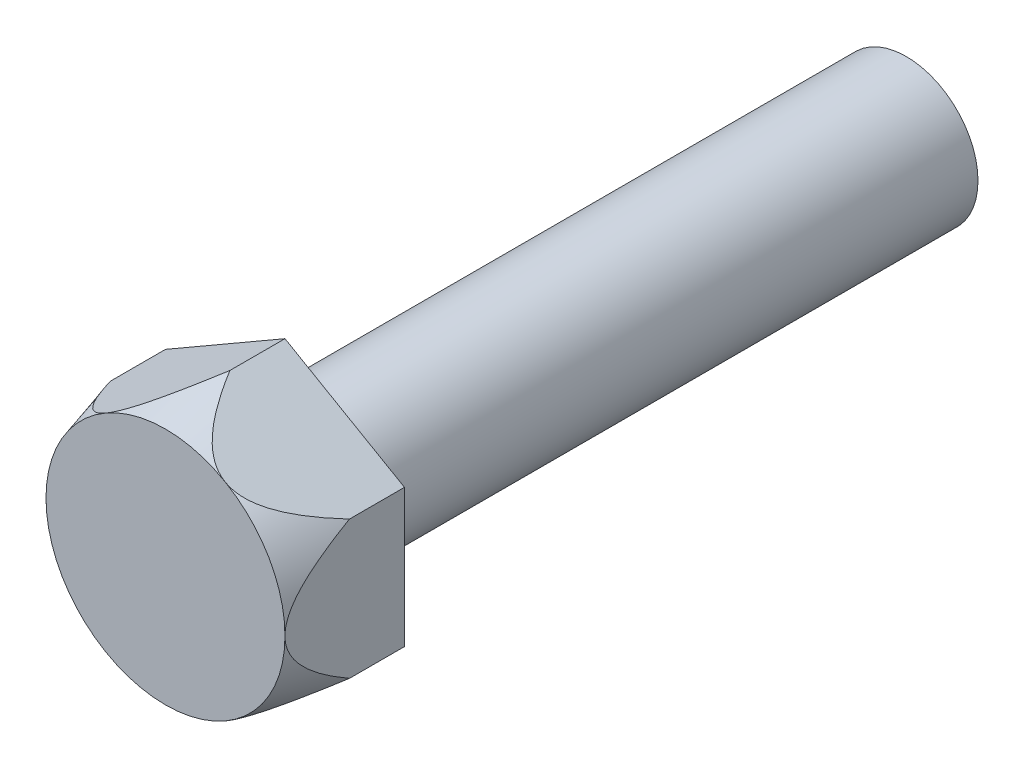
ISO-10303-21;
HEADER;
FILE_DESCRIPTION(('STEP AP214'),'2;1');
FILE_NAME('part.step','',(''),(''),'','','');
FILE_SCHEMA(('AUTOMOTIVE_DESIGN { 1 0 10303 214 1 1 1 1 }'));
ENDSEC;
DATA;
#1=APPLICATION_CONTEXT('core data for automotive mechanical design processes');
#2=APPLICATION_PROTOCOL_DEFINITION('international standard','automotive_design',2000,#1);
#3=PRODUCT_CONTEXT('',#1,'mechanical');
#4=PRODUCT('Part','Part','',(#3));
#5=PRODUCT_RELATED_PRODUCT_CATEGORY('part','',(#4));
#6=PRODUCT_DEFINITION_FORMATION('','',#4);
#7=PRODUCT_DEFINITION_CONTEXT('part definition',#1,'design');
#8=PRODUCT_DEFINITION('design','',#6,#7);
#9=PRODUCT_DEFINITION_SHAPE('','',#8);
#10=(LENGTH_UNIT() NAMED_UNIT(*) SI_UNIT(.MILLI.,.METRE.));
#11=(NAMED_UNIT(*) PLANE_ANGLE_UNIT() SI_UNIT($,.RADIAN.));
#12=(NAMED_UNIT(*) SI_UNIT($,.STERADIAN.) SOLID_ANGLE_UNIT());
#13=UNCERTAINTY_MEASURE_WITH_UNIT(LENGTH_MEASURE(1.E-05),#10,'distance_accuracy_value','');
#14=(GEOMETRIC_REPRESENTATION_CONTEXT(3) GLOBAL_UNCERTAINTY_ASSIGNED_CONTEXT((#13)) GLOBAL_UNIT_ASSIGNED_CONTEXT((#10,
#11,#12)) REPRESENTATION_CONTEXT('',''));
#15=CARTESIAN_POINT('',(0.,0.,0.));
#16=DIRECTION('',(0.,0.,1.));
#17=DIRECTION('',(1.,0.,0.));
#18=AXIS2_PLACEMENT_3D('',#15,#16,#17);
#19=CARTESIAN_POINT('',(0.,2.88675134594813,0.));
#20=DIRECTION('',(0.,0.,1.));
#21=DIRECTION('',(1.,0.,0.));
#22=AXIS2_PLACEMENT_3D('',#19,#20,#21);
#23=PLANE('',#22);
#24=DIRECTION('',(-0.866025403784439,0.5,0.));
#25=VECTOR('',#24,1.);
#26=CARTESIAN_POINT('',(2.5,1.44337567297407,0.));
#27=LINE('',#26,#25);
#28=CARTESIAN_POINT('',(2.5,1.44337567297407,0.));
#29=VERTEX_POINT('',#28);
#30=CARTESIAN_POINT('',(0.,2.88675134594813,0.));
#31=VERTEX_POINT('',#30);
#32=EDGE_CURVE('E113',#29,#31,#27,.T.);
#33=ORIENTED_EDGE('',*,*,#32,.F.);
#34=DIRECTION('',(0.,1.,0.));
#35=VECTOR('',#34,1.);
#36=CARTESIAN_POINT('',(2.5,-1.44337567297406,0.));
#37=LINE('',#36,#35);
#38=CARTESIAN_POINT('',(2.5,-1.44337567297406,0.));
#39=VERTEX_POINT('',#38);
#40=EDGE_CURVE('E260',#39,#29,#37,.T.);
#41=ORIENTED_EDGE('',*,*,#40,.F.);
#42=DIRECTION('',(0.866025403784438,0.5,0.));
#43=VECTOR('',#42,1.);
#44=CARTESIAN_POINT('',(0.,-2.88675134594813,0.));
#45=LINE('',#44,#43);
#46=CARTESIAN_POINT('',(0.,-2.88675134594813,0.));
#47=VERTEX_POINT('',#46);
#48=EDGE_CURVE('E258',#47,#39,#45,.T.);
#49=ORIENTED_EDGE('',*,*,#48,.F.);
#50=DIRECTION('',(0.866025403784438,-0.500000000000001,0.));
#51=VECTOR('',#50,1.);
#52=CARTESIAN_POINT('',(-2.5,-1.44337567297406,0.));
#53=LINE('',#52,#51);
#54=CARTESIAN_POINT('',(-2.5,-1.44337567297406,0.));
#55=VERTEX_POINT('',#54);
#56=EDGE_CURVE('E223',#55,#47,#53,.T.);
#57=ORIENTED_EDGE('',*,*,#56,.F.);
#58=DIRECTION('',(0.,-1.,0.));
#59=VECTOR('',#58,1.);
#60=CARTESIAN_POINT('',(-2.5,1.44337567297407,0.));
#61=LINE('',#60,#59);
#62=CARTESIAN_POINT('',(-2.5,1.44337567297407,0.));
#63=VERTEX_POINT('',#62);
#64=EDGE_CURVE('E266',#63,#55,#61,.T.);
#65=ORIENTED_EDGE('',*,*,#64,.F.);
#66=DIRECTION('',(-0.866025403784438,-0.5,0.));
#67=VECTOR('',#66,1.);
#68=CARTESIAN_POINT('',(0.,2.88675134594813,0.));
#69=LINE('',#68,#67);
#70=EDGE_CURVE('E267',#31,#63,#69,.T.);
#71=ORIENTED_EDGE('',*,*,#70,.F.);
#72=EDGE_LOOP('',(#33,#41,#49,#57,#65,#71));
#73=FACE_BOUND('',#72,.T.);
#74=CARTESIAN_POINT('',(0.,0.,0.));
#75=DIRECTION('',(0.,0.,1.));
#76=DIRECTION('',(1.,0.,0.));
#77=AXIS2_PLACEMENT_3D('',#74,#75,#76);
#78=CIRCLE('',#77,1.5);
#79=CARTESIAN_POINT('',(1.5,0.,0.));
#80=VERTEX_POINT('',#79);
#81=EDGE_CURVE('E12',#80,#80,#78,.F.);
#82=ORIENTED_EDGE('',*,*,#81,.F.);
#83=EDGE_LOOP('',(#82));
#84=FACE_BOUND('',#83,.T.);
#85=ADVANCED_FACE('F31',(#73,#84),#23,.F.);
#86=CARTESIAN_POINT('',(2.5,1.44337567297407,2.5));
#87=DIRECTION('',(-0.5,-0.866025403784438,0.));
#88=DIRECTION('',(0.866025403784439,-0.5,0.));
#89=AXIS2_PLACEMENT_3D('',#86,#87,#88);
#90=PLANE('',#89);
#91=CARTESIAN_POINT('',(2.5002,1.44326020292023,1.15083505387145));
#92=CARTESIAN_POINT('',(2.46262780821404,1.4649525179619,1.22639242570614));
#93=CARTESIAN_POINT('',(2.42415853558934,1.4871627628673,1.30139516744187));
#94=CARTESIAN_POINT('',(2.34471070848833,1.53303198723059,1.44994383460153));
#95=CARTESIAN_POINT('',(2.30372427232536,1.55669551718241,1.52348411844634));
#96=CARTESIAN_POINT('',(2.21828813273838,1.60602209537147,1.66906989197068));
#97=CARTESIAN_POINT('',(2.17380454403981,1.63170470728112,1.74108912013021));
#98=CARTESIAN_POINT('',(2.08092012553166,1.68533155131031,1.88158043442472));
#99=CARTESIAN_POINT('',(2.03252508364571,1.71327244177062,1.95005752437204));
#100=CARTESIAN_POINT('',(1.94461793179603,1.76402565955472,2.06335585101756));
#101=CARTESIAN_POINT('',(1.90636641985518,1.78611018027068,2.10946930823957));
#102=CARTESIAN_POINT('',(1.82639641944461,1.83228088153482,2.1976516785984));
#103=CARTESIAN_POINT('',(1.78467537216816,1.85636853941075,2.23971755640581));
#104=CARTESIAN_POINT('',(1.69645771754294,1.9073010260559,2.31827648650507));
#105=CARTESIAN_POINT('',(1.64990368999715,1.93417900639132,2.35468561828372));
#106=CARTESIAN_POINT('',(1.55206226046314,1.99066778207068,2.4176743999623));
#107=CARTESIAN_POINT('',(1.50079685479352,2.02026587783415,2.44429709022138));
#108=CARTESIAN_POINT('',(1.41287526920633,2.07102742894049,2.47647060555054));
#109=CARTESIAN_POINT('',(1.37736086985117,2.0915316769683,2.48613239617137));
#110=CARTESIAN_POINT('',(1.30541888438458,2.13306740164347,2.49833997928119));
#111=CARTESIAN_POINT('',(1.26899203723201,2.15409845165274,2.50089135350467));
#112=CARTESIAN_POINT('',(1.1963007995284,2.19606675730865,2.49854853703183));
#113=CARTESIAN_POINT('',(1.16003653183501,2.21700394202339,2.49364943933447));
#114=CARTESIAN_POINT('',(1.08871153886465,2.25818344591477,2.47702164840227));
#115=CARTESIAN_POINT('',(1.05365194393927,2.27842511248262,2.46528671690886));
#116=CARTESIAN_POINT('',(0.970709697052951,2.32631184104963,2.42993221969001));
#117=CARTESIAN_POINT('',(0.923780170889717,2.35340661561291,2.40337366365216));
#118=CARTESIAN_POINT('',(0.833970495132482,2.40525825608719,2.34230299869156));
#119=CARTESIAN_POINT('',(0.791104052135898,2.43000720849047,2.30776523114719));
#120=CARTESIAN_POINT('',(0.69998283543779,2.48261606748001,2.2252108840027));
#121=CARTESIAN_POINT('',(0.652622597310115,2.5099595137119,2.17590126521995));
#122=CARTESIAN_POINT('',(0.562166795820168,2.56218419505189,2.07225506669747));
#123=CARTESIAN_POINT('',(0.519079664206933,2.5870605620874,2.01790894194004));
#124=CARTESIAN_POINT('',(0.436086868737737,2.63497647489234,1.90561877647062));
#125=CARTESIAN_POINT('',(0.396198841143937,2.65800583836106,1.84765755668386));
#126=CARTESIAN_POINT('',(0.319122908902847,2.7025056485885,1.72937913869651));
#127=CARTESIAN_POINT('',(0.28193601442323,2.72397551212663,1.66906107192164));
#128=CARTESIAN_POINT('',(0.201791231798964,2.77024712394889,1.53328420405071));
#129=CARTESIAN_POINT('',(0.159362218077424,2.79474352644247,1.45741238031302));
#130=CARTESIAN_POINT('',(0.0775992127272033,2.84194941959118,1.30481344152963));
#131=CARTESIAN_POINT('',(0.0382324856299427,2.86467781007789,1.22810980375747));
#132=CARTESIAN_POINT('',(-0.000200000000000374,2.88686681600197,1.15083505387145));
#133=B_SPLINE_CURVE_WITH_KNOTS('',3,(#91,#92,#93,#94,#95,#96,#97,#98,#99,#100,#101,#102,#103,
#104,#105,#106,#107,#108,#109,#110,#111,#112,#113,#114,#115,#116,#117,#118,#119,#120,#121,#122,
#123,#124,#125,#126,#127,#128,#129,#130,#131,#132),.UNSPECIFIED.,.F.,.F.,(4,2,2,2,2,2,2,2,2,2,2,
2,2,2,2,2,2,2,2,2,4),(0.,0.261426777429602,0.523718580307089,0.78897261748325,1.05384109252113,
1.24522490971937,1.43675114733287,1.63089210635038,1.82416872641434,1.95002630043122,
2.07578504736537,2.20162665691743,2.32758328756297,2.50758855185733,2.68818091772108,
2.90857365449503,3.12939296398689,3.35135612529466,3.57340187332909,3.84426931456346,
4.11166010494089),.UNSPECIFIED.);
#134=CARTESIAN_POINT('',(2.5,1.44337567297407,1.15123776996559));
#135=VERTEX_POINT('',#134);
#136=CARTESIAN_POINT('',(1.25,2.1650635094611,2.5));
#137=VERTEX_POINT('',#136);
#138=EDGE_CURVE('E106',#135,#137,#133,.T.);
#139=ORIENTED_EDGE('',*,*,#138,.F.);
#140=DIRECTION('',(0.,0.,-1.));
#141=VECTOR('',#140,1.);
#142=CARTESIAN_POINT('',(2.5,1.44337567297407,2.5));
#143=LINE('',#142,#141);
#144=EDGE_CURVE('E55',#135,#29,#143,.T.);
#145=ORIENTED_EDGE('',*,*,#144,.T.);
#146=ORIENTED_EDGE('',*,*,#32,.T.);
#147=DIRECTION('',(0.,0.,-1.));
#148=VECTOR('',#147,1.);
#149=CARTESIAN_POINT('',(0.,2.88675134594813,2.5));
#150=LINE('',#149,#148);
#151=CARTESIAN_POINT('',(0.,2.88675134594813,1.15123776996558));
#152=VERTEX_POINT('',#151);
#153=EDGE_CURVE('E129',#152,#31,#150,.T.);
#154=ORIENTED_EDGE('',*,*,#153,.F.);
#155=EDGE_CURVE('E114',#137,#152,#133,.T.);
#156=ORIENTED_EDGE('',*,*,#155,.F.);
#157=EDGE_LOOP('',(#139,#145,#146,#154,#156));
#158=FACE_BOUND('',#157,.T.);
#159=ADVANCED_FACE('F33',(#158),#90,.F.);
#160=CARTESIAN_POINT('',(0.,2.88675134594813,2.5));
#161=DIRECTION('',(0.5,-0.866025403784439,0.));
#162=DIRECTION('',(0.866025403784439,0.5,0.));
#163=AXIS2_PLACEMENT_3D('',#160,#161,#162);
#164=PLANE('',#163);
#165=CARTESIAN_POINT('',(0.000200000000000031,2.88686681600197,1.15083505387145));
#166=CARTESIAN_POINT('',(-0.0373721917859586,2.8651745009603,1.22639242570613));
#167=CARTESIAN_POINT('',(-0.0758414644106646,2.8429642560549,1.30139516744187));
#168=CARTESIAN_POINT('',(-0.155289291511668,2.7970950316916,1.44994383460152));
#169=CARTESIAN_POINT('',(-0.19627572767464,2.77343150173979,1.52348411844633));
#170=CARTESIAN_POINT('',(-0.281711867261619,2.72410492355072,1.66906989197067));
#171=CARTESIAN_POINT('',(-0.326195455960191,2.69842231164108,1.74108912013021));
#172=CARTESIAN_POINT('',(-0.419079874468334,2.64479546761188,1.88158043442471));
#173=CARTESIAN_POINT('',(-0.467474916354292,2.61685457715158,1.95005752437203));
#174=CARTESIAN_POINT('',(-0.555382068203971,2.56610135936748,2.06335585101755));
#175=CARTESIAN_POINT('',(-0.593633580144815,2.54401683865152,2.10946930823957));
#176=CARTESIAN_POINT('',(-0.673603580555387,2.49784613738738,2.1976516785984));
#177=CARTESIAN_POINT('',(-0.715324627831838,2.47375847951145,2.23971755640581));
#178=CARTESIAN_POINT('',(-0.803542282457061,2.4228259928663,2.31827648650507));
#179=CARTESIAN_POINT('',(-0.850096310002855,2.39594801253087,2.35468561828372));
#180=CARTESIAN_POINT('',(-0.947937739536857,2.33945923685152,2.4176743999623));
#181=CARTESIAN_POINT('',(-0.999203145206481,2.30986114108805,2.44429709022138));
#182=CARTESIAN_POINT('',(-1.08712473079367,2.25909958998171,2.47647060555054));
#183=CARTESIAN_POINT('',(-1.12263913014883,2.2385953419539,2.48613239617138));
#184=CARTESIAN_POINT('',(-1.19458111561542,2.19705961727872,2.49833997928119));
#185=CARTESIAN_POINT('',(-1.231007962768,2.17602856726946,2.50089135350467));
#186=CARTESIAN_POINT('',(-1.3036992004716,2.13406026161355,2.49854853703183));
#187=CARTESIAN_POINT('',(-1.339963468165,2.11312307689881,2.49364943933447));
#188=CARTESIAN_POINT('',(-1.41128846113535,2.07194357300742,2.47702164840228));
#189=CARTESIAN_POINT('',(-1.44634805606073,2.05170190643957,2.46528671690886));
#190=CARTESIAN_POINT('',(-1.52929030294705,2.00381517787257,2.42993221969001));
#191=CARTESIAN_POINT('',(-1.57621982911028,1.97672040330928,2.40337366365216));
#192=CARTESIAN_POINT('',(-1.66602950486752,1.92486876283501,2.34230299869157));
#193=CARTESIAN_POINT('',(-1.7088959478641,1.90011981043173,2.30776523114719));
#194=CARTESIAN_POINT('',(-1.80001716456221,1.84751095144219,2.22521088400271));
#195=CARTESIAN_POINT('',(-1.84737740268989,1.82016750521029,2.17590126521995));
#196=CARTESIAN_POINT('',(-1.93783320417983,1.76794282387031,2.07225506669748));
#197=CARTESIAN_POINT('',(-1.98092033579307,1.7430664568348,2.01790894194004));
#198=CARTESIAN_POINT('',(-2.06391313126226,1.69515054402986,1.90561877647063));
#199=CARTESIAN_POINT('',(-2.10380115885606,1.67212118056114,1.84765755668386));
#200=CARTESIAN_POINT('',(-2.18087709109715,1.6276213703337,1.72937913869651));
#201=CARTESIAN_POINT('',(-2.21806398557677,1.60615150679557,1.66906107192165));
#202=CARTESIAN_POINT('',(-2.29820876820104,1.5598798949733,1.53328420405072));
#203=CARTESIAN_POINT('',(-2.34063778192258,1.53538349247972,1.45741238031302));
#204=CARTESIAN_POINT('',(-2.4224007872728,1.48817759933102,1.30481344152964));
#205=CARTESIAN_POINT('',(-2.46176751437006,1.4654492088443,1.22810980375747));
#206=CARTESIAN_POINT('',(-2.5002,1.44326020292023,1.15083505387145));
#207=B_SPLINE_CURVE_WITH_KNOTS('',3,(#165,#166,#167,#168,#169,#170,#171,#172,#173,#174,#175,
#176,#177,#178,#179,#180,#181,#182,#183,#184,#185,#186,#187,#188,#189,#190,#191,#192,#193,#194,
#195,#196,#197,#198,#199,#200,#201,#202,#203,#204,#205,#206),.UNSPECIFIED.,.F.,.F.,(4,2,2,2,2,2,
2,2,2,2,2,2,2,2,2,2,2,2,2,2,4),(0.,0.261426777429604,0.52371858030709,0.788972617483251,
1.05384109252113,1.24522490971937,1.43675114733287,1.63089210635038,1.82416872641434,
1.95002630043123,2.07578504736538,2.20162665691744,2.32758328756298,2.50758855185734,
2.68818091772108,2.90857365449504,3.12939296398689,3.35135612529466,3.5734018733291,
3.84426931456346,4.11166010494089),.UNSPECIFIED.);
#208=CARTESIAN_POINT('',(-1.25,2.1650635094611,2.5));
#209=VERTEX_POINT('',#208);
#210=EDGE_CURVE('E120',#152,#209,#207,.T.);
#211=ORIENTED_EDGE('',*,*,#210,.F.);
#212=ORIENTED_EDGE('',*,*,#153,.T.);
#213=ORIENTED_EDGE('',*,*,#70,.T.);
#214=DIRECTION('',(0.,0.,-1.));
#215=VECTOR('',#214,1.);
#216=CARTESIAN_POINT('',(-2.5,1.44337567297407,2.5));
#217=LINE('',#216,#215);
#218=CARTESIAN_POINT('',(-2.5,1.44337567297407,1.15123776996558));
#219=VERTEX_POINT('',#218);
#220=EDGE_CURVE('E228',#219,#63,#217,.T.);
#221=ORIENTED_EDGE('',*,*,#220,.F.);
#222=EDGE_CURVE('E130',#209,#219,#207,.T.);
#223=ORIENTED_EDGE('',*,*,#222,.F.);
#224=EDGE_LOOP('',(#211,#212,#213,#221,#223));
#225=FACE_BOUND('',#224,.T.);
#226=ADVANCED_FACE('F183',(#225),#164,.F.);
#227=CARTESIAN_POINT('',(-2.5,1.44337567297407,2.5));
#228=DIRECTION('',(1.,0.,0.));
#229=DIRECTION('',(0.,1.,0.));
#230=AXIS2_PLACEMENT_3D('',#227,#228,#229);
#231=PLANE('',#230);
#232=CARTESIAN_POINT('',(-2.5,-3.21752762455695,-2.9913336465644));
#233=CARTESIAN_POINT('',(-2.5,-3.15535498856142,-2.82015628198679));
#234=CARTESIAN_POINT('',(-2.5,-3.09260471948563,-2.64918607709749));
#235=CARTESIAN_POINT('',(-2.5,-2.96567116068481,-2.30775545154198));
#236=CARTESIAN_POINT('',(-2.5,-2.90148769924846,-2.13729509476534));
#237=CARTESIAN_POINT('',(-2.5,-2.77110200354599,-1.79617628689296));
#238=CARTESIAN_POINT('',(-2.5,-2.70489132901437,-1.62552105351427));
#239=CARTESIAN_POINT('',(-2.5,-2.57037827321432,-1.28504937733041));
#240=CARTESIAN_POINT('',(-2.5,-2.50207604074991,-1.11523287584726));
#241=CARTESIAN_POINT('',(-2.5,-2.35767199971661,-0.764037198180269));
#242=CARTESIAN_POINT('',(-2.5,-2.28136846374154,-0.582740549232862));
#243=CARTESIAN_POINT('',(-2.5,-2.12482765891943,-0.221800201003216));
#244=CARTESIAN_POINT('',(-2.5,-2.04458952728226,-0.0421568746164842));
#245=CARTESIAN_POINT('',(-2.5,-1.87903138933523,0.31430238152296));
#246=CARTESIAN_POINT('',(-2.5,-1.79372354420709,0.491123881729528));
#247=CARTESIAN_POINT('',(-2.5,-1.66017597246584,0.753474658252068));
#248=CARTESIAN_POINT('',(-2.5,-1.61473814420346,0.840428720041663));
#249=CARTESIAN_POINT('',(-2.5,-1.52156700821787,1.01309445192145));
#250=CARTESIAN_POINT('',(-2.5,-1.47383392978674,1.09880624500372));
#251=CARTESIAN_POINT('',(-2.5,-1.37978404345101,1.26119903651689));
#252=CARTESIAN_POINT('',(-2.5,-1.33370505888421,1.33801717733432));
#253=CARTESIAN_POINT('',(-2.5,-1.23854079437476,1.48984468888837));
#254=CARTESIAN_POINT('',(-2.5,-1.18945383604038,1.56485301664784));
#255=CARTESIAN_POINT('',(-2.5,-1.08791843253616,1.71160624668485));
#256=CARTESIAN_POINT('',(-2.5,-1.03550332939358,1.78337403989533));
#257=CARTESIAN_POINT('',(-2.5,-0.925822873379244,1.92306807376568));
#258=CARTESIAN_POINT('',(-2.5,-0.868562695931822,1.99099828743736));
#259=CARTESIAN_POINT('',(-2.5,-0.766452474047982,2.1005031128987));
#260=CARTESIAN_POINT('',(-2.5,-0.723327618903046,2.14367208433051));
#261=CARTESIAN_POINT('',(-2.5,-0.633176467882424,2.22600038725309));
#262=CARTESIAN_POINT('',(-2.5,-0.586142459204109,2.26515143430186));
#263=CARTESIAN_POINT('',(-2.5,-0.486885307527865,2.33783157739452));
#264=CARTESIAN_POINT('',(-2.5,-0.434603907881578,2.37128305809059));
#265=CARTESIAN_POINT('',(-2.5,-0.32503896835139,2.42862131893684));
#266=CARTESIAN_POINT('',(-2.5,-0.267776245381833,2.45254577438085));
#267=CARTESIAN_POINT('',(-2.5,-0.168404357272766,2.48135609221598));
#268=CARTESIAN_POINT('',(-2.5,-0.127366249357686,2.4898940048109));
#269=CARTESIAN_POINT('',(-2.5,-0.0444291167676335,2.49981640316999));
#270=CARTESIAN_POINT('',(-2.5,-0.00253074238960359,2.50120610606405));
#271=CARTESIAN_POINT('',(-2.5,0.0808401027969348,2.49665541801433));
#272=CARTESIAN_POINT('',(-2.5,0.122312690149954,2.49071708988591));
#273=CARTESIAN_POINT('',(-2.5,0.203742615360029,2.47224682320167));
#274=CARTESIAN_POINT('',(-2.5,0.243698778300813,2.45970987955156));
#275=CARTESIAN_POINT('',(-2.5,0.340274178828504,2.42188535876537));
#276=CARTESIAN_POINT('',(-2.5,0.395609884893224,2.39336365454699));
#277=CARTESIAN_POINT('',(-2.5,0.501345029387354,2.32828576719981));
#278=CARTESIAN_POINT('',(-2.5,0.551727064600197,2.29170262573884));
#279=CARTESIAN_POINT('',(-2.5,0.66055832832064,2.20314313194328));
#280=CARTESIAN_POINT('',(-2.5,0.71773553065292,2.14963039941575));
#281=CARTESIAN_POINT('',(-2.5,0.826783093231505,2.03738592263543));
#282=CARTESIAN_POINT('',(-2.5,0.878642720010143,1.97864405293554));
#283=CARTESIAN_POINT('',(-2.5,0.978831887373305,1.85699899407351));
#284=CARTESIAN_POINT('',(-2.5,1.02710803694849,1.79405232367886));
#285=CARTESIAN_POINT('',(-2.5,1.12027488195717,1.66582764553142));
#286=CARTESIAN_POINT('',(-2.5,1.16516902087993,1.60055211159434));
#287=CARTESIAN_POINT('',(-2.5,1.25833284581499,1.45912877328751));
#288=CARTESIAN_POINT('',(-2.5,1.30621178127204,1.38272498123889));
#289=CARTESIAN_POINT('',(-2.5,1.39926428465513,1.22828087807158));
#290=CARTESIAN_POINT('',(-2.5,1.44443733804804,1.15024025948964));
#291=CARTESIAN_POINT('',(-2.5,1.57676311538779,0.914190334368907));
#292=CARTESIAN_POINT('',(-2.5,1.66065618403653,0.754357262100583));
#293=CARTESIAN_POINT('',(-2.5,1.82278886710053,0.43111132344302));
#294=CARTESIAN_POINT('',(-2.5,1.90100483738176,0.267686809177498));
#295=CARTESIAN_POINT('',(-2.5,2.05300466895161,-0.0611218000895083));
#296=CARTESIAN_POINT('',(-2.5,2.12679031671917,-0.226505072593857));
#297=CARTESIAN_POINT('',(-2.5,2.26257316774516,-0.53925513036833));
#298=CARTESIAN_POINT('',(-2.5,2.32493879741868,-0.68646300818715));
#299=CARTESIAN_POINT('',(-2.5,2.44757723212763,-0.981767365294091));
#300=CARTESIAN_POINT('',(-2.5,2.50784978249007,-1.12986395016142));
#301=CARTESIAN_POINT('',(-2.5,2.626201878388,-1.4255620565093));
#302=CARTESIAN_POINT('',(-2.5,2.68429506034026,-1.57315813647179));
#303=CARTESIAN_POINT('',(-2.5,2.79904379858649,-1.86887689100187));
#304=CARTESIAN_POINT('',(-2.5,2.85569962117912,-2.01699946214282));
#305=CARTESIAN_POINT('',(-2.5,2.91177514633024,-2.16533839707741));
#306=B_SPLINE_CURVE_WITH_KNOTS('',3,(#232,#233,#234,#235,#236,#237,#238,#239,#240,#241,#242,
#243,#244,#245,#246,#247,#248,#249,#250,#251,#252,#253,#254,#255,#256,#257,#258,#259,#260,#261,
#262,#263,#264,#265,#266,#267,#268,#269,#270,#271,#272,#273,#274,#275,#276,#277,#278,#279,#280,
#281,#282,#283,#284,#285,#286,#287,#288,#289,#290,#291,#292,#293,#294,#295,#296,#297,#298,#299,
#300,#301,#302,#303,#304,#305),.UNSPECIFIED.,.F.,.F.,(4,2,2,2,2,2,2,2,2,2,2,2,2,2,2,2,2,2,2,2,2,
2,2,2,2,2,2,2,2,2,2,2,2,2,2,2,4),(0.,0.54635796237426,1.09278173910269,1.64191821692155,
2.19101571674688,2.78107775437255,3.37126976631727,3.96009909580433,4.25440398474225,
4.54867953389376,4.81736391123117,5.08619959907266,5.35267210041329,5.61886346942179,
5.80173877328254,5.98498387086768,6.17055346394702,6.35538174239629,6.48058255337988,
6.60569197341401,6.73076618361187,6.85593540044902,7.04162100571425,7.2279372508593,
7.46232030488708,7.69716751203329,7.93500669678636,8.17260035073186,8.44302437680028,
8.71349966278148,9.25482037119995,9.79827964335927,10.3415182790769,10.8211217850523,
11.3007834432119,11.776627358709,12.2523824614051),.UNSPECIFIED.);
#307=CARTESIAN_POINT('',(-2.5,0.,2.5));
#308=VERTEX_POINT('',#307);
#309=EDGE_CURVE('E177',#219,#308,#306,.F.);
#310=ORIENTED_EDGE('',*,*,#309,.F.);
#311=ORIENTED_EDGE('',*,*,#220,.T.);
#312=ORIENTED_EDGE('',*,*,#64,.T.);
#313=DIRECTION('',(0.,0.,-1.));
#314=VECTOR('',#313,1.);
#315=CARTESIAN_POINT('',(-2.5,-1.44337567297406,2.5));
#316=LINE('',#315,#314);
#317=CARTESIAN_POINT('',(-2.5,-1.44337567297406,1.15123776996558));
#318=VERTEX_POINT('',#317);
#319=EDGE_CURVE('E225',#318,#55,#316,.T.);
#320=ORIENTED_EDGE('',*,*,#319,.F.);
#321=EDGE_CURVE('E172',#308,#318,#306,.F.);
#322=ORIENTED_EDGE('',*,*,#321,.F.);
#323=EDGE_LOOP('',(#310,#311,#312,#320,#322));
#324=FACE_BOUND('',#323,.T.);
#325=ADVANCED_FACE('F179',(#324),#231,.F.);
#326=CARTESIAN_POINT('',(-2.5,-1.44337567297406,2.5));
#327=DIRECTION('',(0.500000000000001,0.866025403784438,0.));
#328=DIRECTION('',(-0.866025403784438,0.500000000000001,0.));
#329=AXIS2_PLACEMENT_3D('',#326,#327,#328);
#330=PLANE('',#329);
#331=CARTESIAN_POINT('',(-2.5002,-1.44326020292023,1.15083505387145));
#332=CARTESIAN_POINT('',(-2.46262780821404,-1.46495251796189,1.22639242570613));
#333=CARTESIAN_POINT('',(-2.42415853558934,-1.4871627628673,1.30139516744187));
#334=CARTESIAN_POINT('',(-2.34471070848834,-1.53303198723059,1.44994383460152));
#335=CARTESIAN_POINT('',(-2.30372427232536,-1.55669551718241,1.52348411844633));
#336=CARTESIAN_POINT('',(-2.21828813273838,-1.60602209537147,1.66906989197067));
#337=CARTESIAN_POINT('',(-2.17380454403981,-1.63170470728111,1.74108912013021));
#338=CARTESIAN_POINT('',(-2.08092012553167,-1.68533155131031,1.88158043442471));
#339=CARTESIAN_POINT('',(-2.03252508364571,-1.71327244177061,1.95005752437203));
#340=CARTESIAN_POINT('',(-1.94461793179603,-1.76402565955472,2.06335585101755));
#341=CARTESIAN_POINT('',(-1.90636641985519,-1.78611018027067,2.10946930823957));
#342=CARTESIAN_POINT('',(-1.82639641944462,-1.83228088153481,2.19765167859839));
#343=CARTESIAN_POINT('',(-1.78467537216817,-1.85636853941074,2.23971755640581));
#344=CARTESIAN_POINT('',(-1.69645771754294,-1.90730102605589,2.31827648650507));
#345=CARTESIAN_POINT('',(-1.64990368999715,-1.93417900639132,2.35468561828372));
#346=CARTESIAN_POINT('',(-1.55206226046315,-1.99066778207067,2.4176743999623));
#347=CARTESIAN_POINT('',(-1.50079685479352,-2.02026587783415,2.44429709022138));
#348=CARTESIAN_POINT('',(-1.41287526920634,-2.07102742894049,2.47647060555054));
#349=CARTESIAN_POINT('',(-1.37736086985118,-2.0915316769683,2.48613239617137));
#350=CARTESIAN_POINT('',(-1.30541888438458,-2.13306740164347,2.49833997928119));
#351=CARTESIAN_POINT('',(-1.26899203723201,-2.15409845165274,2.50089135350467));
#352=CARTESIAN_POINT('',(-1.1963007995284,-2.19606675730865,2.49854853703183));
#353=CARTESIAN_POINT('',(-1.16003653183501,-2.21700394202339,2.49364943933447));
#354=CARTESIAN_POINT('',(-1.08871153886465,-2.25818344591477,2.47702164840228));
#355=CARTESIAN_POINT('',(-1.05365194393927,-2.27842511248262,2.46528671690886));
#356=CARTESIAN_POINT('',(-0.970709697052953,-2.32631184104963,2.42993221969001));
#357=CARTESIAN_POINT('',(-0.923780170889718,-2.35340661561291,2.40337366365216));
#358=CARTESIAN_POINT('',(-0.833970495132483,-2.40525825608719,2.34230299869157));
#359=CARTESIAN_POINT('',(-0.7911040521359,-2.43000720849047,2.30776523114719));
#360=CARTESIAN_POINT('',(-0.699982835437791,-2.48261606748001,2.2252108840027));
#361=CARTESIAN_POINT('',(-0.652622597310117,-2.5099595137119,2.17590126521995));
#362=CARTESIAN_POINT('',(-0.56216679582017,-2.56218419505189,2.07225506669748));
#363=CARTESIAN_POINT('',(-0.519079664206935,-2.5870605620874,2.01790894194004));
#364=CARTESIAN_POINT('',(-0.436086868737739,-2.63497647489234,1.90561877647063));
#365=CARTESIAN_POINT('',(-0.396198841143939,-2.65800583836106,1.84765755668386));
#366=CARTESIAN_POINT('',(-0.31912290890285,-2.70250564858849,1.72937913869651));
#367=CARTESIAN_POINT('',(-0.281936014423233,-2.72397551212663,1.66906107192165));
#368=CARTESIAN_POINT('',(-0.201791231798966,-2.77024712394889,1.53328420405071));
#369=CARTESIAN_POINT('',(-0.159362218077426,-2.79474352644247,1.45741238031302));
#370=CARTESIAN_POINT('',(-0.077599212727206,-2.84194941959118,1.30481344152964));
#371=CARTESIAN_POINT('',(-0.0382324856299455,-2.86467781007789,1.22810980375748));
#372=CARTESIAN_POINT('',(0.000199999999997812,-2.88686681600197,1.15083505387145));
#373=B_SPLINE_CURVE_WITH_KNOTS('',3,(#331,#332,#333,#334,#335,#336,#337,#338,#339,#340,#341,
#342,#343,#344,#345,#346,#347,#348,#349,#350,#351,#352,#353,#354,#355,#356,#357,#358,#359,#360,
#361,#362,#363,#364,#365,#366,#367,#368,#369,#370,#371,#372),.UNSPECIFIED.,.F.,.F.,(4,2,2,2,2,2,
2,2,2,2,2,2,2,2,2,2,2,2,2,2,4),(0.,0.261426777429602,0.523718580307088,0.788972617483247,
1.05384109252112,1.24522490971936,1.43675114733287,1.63089210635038,1.82416872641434,
1.95002630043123,2.07578504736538,2.20162665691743,2.32758328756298,2.50758855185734,
2.68818091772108,2.90857365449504,3.12939296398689,3.35135612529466,3.5734018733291,
3.84426931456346,4.11166010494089),.UNSPECIFIED.);
#374=CARTESIAN_POINT('',(-1.25,-2.1650635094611,2.5));
#375=VERTEX_POINT('',#374);
#376=EDGE_CURVE('E178',#318,#375,#373,.T.);
#377=ORIENTED_EDGE('',*,*,#376,.F.);
#378=ORIENTED_EDGE('',*,*,#319,.T.);
#379=ORIENTED_EDGE('',*,*,#56,.T.);
#380=DIRECTION('',(0.,0.,-1.));
#381=VECTOR('',#380,1.);
#382=CARTESIAN_POINT('',(0.,-2.88675134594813,2.5));
#383=LINE('',#382,#381);
#384=CARTESIAN_POINT('',(0.,-2.88675134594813,1.15123776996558));
#385=VERTEX_POINT('',#384);
#386=EDGE_CURVE('E215',#385,#47,#383,.T.);
#387=ORIENTED_EDGE('',*,*,#386,.F.);
#388=EDGE_CURVE('E167',#375,#385,#373,.T.);
#389=ORIENTED_EDGE('',*,*,#388,.F.);
#390=EDGE_LOOP('',(#377,#378,#379,#387,#389));
#391=FACE_BOUND('',#390,.T.);
#392=ADVANCED_FACE('F182',(#391),#330,.F.);
#393=CARTESIAN_POINT('',(0.,-2.88675134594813,2.5));
#394=DIRECTION('',(-0.5,0.866025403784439,0.));
#395=DIRECTION('',(-0.866025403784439,-0.5,0.));
#396=AXIS2_PLACEMENT_3D('',#393,#394,#395);
#397=PLANE('',#396);
#398=CARTESIAN_POINT('',(-0.000200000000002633,-2.88686681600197,1.15083505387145));
#399=CARTESIAN_POINT('',(0.0373721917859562,-2.8651745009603,1.22639242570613));
#400=CARTESIAN_POINT('',(0.075841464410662,-2.8429642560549,1.30139516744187));
#401=CARTESIAN_POINT('',(0.155289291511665,-2.7970950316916,1.44994383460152));
#402=CARTESIAN_POINT('',(0.196275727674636,-2.77343150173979,1.52348411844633));
#403=CARTESIAN_POINT('',(0.281711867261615,-2.72410492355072,1.66906989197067));
#404=CARTESIAN_POINT('',(0.326195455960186,-2.69842231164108,1.74108912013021));
#405=CARTESIAN_POINT('',(0.419079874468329,-2.64479546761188,1.88158043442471));
#406=CARTESIAN_POINT('',(0.467474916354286,-2.61685457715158,1.95005752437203));
#407=CARTESIAN_POINT('',(0.555382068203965,-2.56610135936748,2.06335585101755));
#408=CARTESIAN_POINT('',(0.593633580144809,-2.54401683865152,2.10946930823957));
#409=CARTESIAN_POINT('',(0.673603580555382,-2.49784613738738,2.1976516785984));
#410=CARTESIAN_POINT('',(0.715324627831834,-2.47375847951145,2.23971755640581));
#411=CARTESIAN_POINT('',(0.803542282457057,-2.4228259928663,2.31827648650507));
#412=CARTESIAN_POINT('',(0.850096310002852,-2.39594801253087,2.35468561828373));
#413=CARTESIAN_POINT('',(0.947937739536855,-2.33945923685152,2.41767439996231));
#414=CARTESIAN_POINT('',(0.999203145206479,-2.30986114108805,2.44429709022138));
#415=CARTESIAN_POINT('',(1.08712473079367,-2.25909958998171,2.47647060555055));
#416=CARTESIAN_POINT('',(1.12263913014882,-2.2385953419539,2.48613239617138));
#417=CARTESIAN_POINT('',(1.19458111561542,-2.19705961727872,2.4983399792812));
#418=CARTESIAN_POINT('',(1.23100796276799,-2.17602856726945,2.50089135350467));
#419=CARTESIAN_POINT('',(1.3036992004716,-2.13406026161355,2.49854853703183));
#420=CARTESIAN_POINT('',(1.33996346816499,-2.1131230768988,2.49364943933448));
#421=CARTESIAN_POINT('',(1.41128846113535,-2.07194357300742,2.47702164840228));
#422=CARTESIAN_POINT('',(1.44634805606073,-2.05170190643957,2.46528671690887));
#423=CARTESIAN_POINT('',(1.52929030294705,-2.00381517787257,2.42993221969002));
#424=CARTESIAN_POINT('',(1.57621982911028,-1.97672040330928,2.40337366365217));
#425=CARTESIAN_POINT('',(1.66602950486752,-1.92486876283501,2.34230299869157));
#426=CARTESIAN_POINT('',(1.7088959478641,-1.90011981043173,2.3077652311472));
#427=CARTESIAN_POINT('',(1.80001716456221,-1.84751095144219,2.22521088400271));
#428=CARTESIAN_POINT('',(1.84737740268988,-1.82016750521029,2.17590126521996));
#429=CARTESIAN_POINT('',(1.93783320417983,-1.76794282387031,2.07225506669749));
#430=CARTESIAN_POINT('',(1.98092033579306,-1.7430664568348,2.01790894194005));
#431=CARTESIAN_POINT('',(2.06391313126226,-1.69515054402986,1.90561877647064));
#432=CARTESIAN_POINT('',(2.10380115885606,-1.67212118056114,1.84765755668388));
#433=CARTESIAN_POINT('',(2.18087709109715,-1.6276213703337,1.72937913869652));
#434=CARTESIAN_POINT('',(2.21806398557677,-1.60615150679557,1.66906107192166));
#435=CARTESIAN_POINT('',(2.29820876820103,-1.5598798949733,1.53328420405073));
#436=CARTESIAN_POINT('',(2.34063778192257,-1.53538349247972,1.45741238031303));
#437=CARTESIAN_POINT('',(2.42240078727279,-1.48817759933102,1.30481344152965));
#438=CARTESIAN_POINT('',(2.46176751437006,-1.4654492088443,1.22810980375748));
#439=CARTESIAN_POINT('',(2.5002,-1.44326020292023,1.15083505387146));
#440=B_SPLINE_CURVE_WITH_KNOTS('',3,(#398,#399,#400,#401,#402,#403,#404,#405,#406,#407,#408,
#409,#410,#411,#412,#413,#414,#415,#416,#417,#418,#419,#420,#421,#422,#423,#424,#425,#426,#427,
#428,#429,#430,#431,#432,#433,#434,#435,#436,#437,#438,#439),.UNSPECIFIED.,.F.,.F.,(4,2,2,2,2,2,
2,2,2,2,2,2,2,2,2,2,2,2,2,2,4),(0.,0.261426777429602,0.523718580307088,0.788972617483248,
1.05384109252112,1.24522490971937,1.43675114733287,1.63089210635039,1.82416872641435,
1.95002630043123,2.07578504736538,2.20162665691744,2.32758328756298,2.50758855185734,
2.68818091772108,2.90857365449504,3.12939296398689,3.35135612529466,3.57340187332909,
3.84426931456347,4.1116601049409),.UNSPECIFIED.);
#441=CARTESIAN_POINT('',(1.25,-2.1650635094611,2.5));
#442=VERTEX_POINT('',#441);
#443=EDGE_CURVE('E212',#385,#442,#440,.T.);
#444=ORIENTED_EDGE('',*,*,#443,.F.);
#445=ORIENTED_EDGE('',*,*,#386,.T.);
#446=ORIENTED_EDGE('',*,*,#48,.T.);
#447=DIRECTION('',(0.,0.,-1.));
#448=VECTOR('',#447,1.);
#449=CARTESIAN_POINT('',(2.5,-1.44337567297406,2.5));
#450=LINE('',#449,#448);
#451=CARTESIAN_POINT('',(2.5,-1.44337567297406,1.15123776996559));
#452=VERTEX_POINT('',#451);
#453=EDGE_CURVE('E226',#452,#39,#450,.T.);
#454=ORIENTED_EDGE('',*,*,#453,.F.);
#455=EDGE_CURVE('E161',#442,#452,#440,.T.);
#456=ORIENTED_EDGE('',*,*,#455,.F.);
#457=EDGE_LOOP('',(#444,#445,#446,#454,#456));
#458=FACE_BOUND('',#457,.T.);
#459=ADVANCED_FACE('F201',(#458),#397,.F.);
#460=CARTESIAN_POINT('',(2.5,-1.44337567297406,2.5));
#461=DIRECTION('',(-1.,0.,0.));
#462=DIRECTION('',(0.,0.,1.));
#463=AXIS2_PLACEMENT_3D('',#460,#461,#462);
#464=PLANE('',#463);
#465=CARTESIAN_POINT('',(2.5,-3.21752762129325,-2.99133363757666));
#466=CARTESIAN_POINT('',(2.5,-3.15535498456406,-2.82015627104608));
#467=CARTESIAN_POINT('',(2.5,-3.09260471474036,-2.6491860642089));
#468=CARTESIAN_POINT('',(2.5,-2.96567115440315,-2.30775543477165));
#469=CARTESIAN_POINT('',(2.5,-2.90148769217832,-2.13729507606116));
#470=CARTESIAN_POINT('',(2.5,-2.77110199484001,-1.79617626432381));
#471=CARTESIAN_POINT('',(2.5,-2.70489131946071,-1.62552102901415));
#472=CARTESIAN_POINT('',(2.5,-2.57037826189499,-1.28504934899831));
#473=CARTESIAN_POINT('',(2.5,-2.5020760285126,-1.11523284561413));
#474=CARTESIAN_POINT('',(2.5,-2.35767198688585,-0.764037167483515));
#475=CARTESIAN_POINT('',(2.5,-2.28136845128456,-0.582740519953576));
#476=CARTESIAN_POINT('',(2.5,-2.12482764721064,-0.22180017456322));
#477=CARTESIAN_POINT('',(2.5,-2.04458951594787,-0.0421568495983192));
#478=CARTESIAN_POINT('',(2.5,-1.87903137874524,0.314302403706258));
#479=CARTESIAN_POINT('',(2.5,-1.79372353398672,0.491123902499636));
#480=CARTESIAN_POINT('',(2.5,-1.66017596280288,0.75347467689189));
#481=CARTESIAN_POINT('',(2.5,-1.61473813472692,0.840428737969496));
#482=CARTESIAN_POINT('',(2.5,-1.52156699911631,1.0130944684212));
#483=CARTESIAN_POINT('',(2.5,-1.47383392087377,1.09880626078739));
#484=CARTESIAN_POINT('',(2.5,-1.37978404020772,1.26119904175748));
#485=CARTESIAN_POINT('',(2.5,-1.33370506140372,1.33801717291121));
#486=CARTESIAN_POINT('',(2.5,-1.23854080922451,1.48984466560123));
#487=CARTESIAN_POINT('',(2.5,-1.18945385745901,1.56485298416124));
#488=CARTESIAN_POINT('',(2.5,-1.08791846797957,1.71160619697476));
#489=CARTESIAN_POINT('',(2.5,-1.03550337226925,1.78337398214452));
#490=CARTESIAN_POINT('',(2.5,-0.92582293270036,1.92306800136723));
#491=CARTESIAN_POINT('',(2.5,-0.868562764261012,1.99099820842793));
#492=CARTESIAN_POINT('',(2.5,-0.7664525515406,2.10050303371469));
#493=CARTESIAN_POINT('',(2.5,-0.723327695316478,2.14367201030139));
#494=CARTESIAN_POINT('',(2.5,-0.633176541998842,2.22600032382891));
#495=CARTESIAN_POINT('',(2.5,-0.586142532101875,2.26515137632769));
#496=CARTESIAN_POINT('',(2.5,-0.486885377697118,2.33783153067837));
#497=CARTESIAN_POINT('',(2.5,-0.434603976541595,2.37128301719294));
#498=CARTESIAN_POINT('',(2.5,-0.325039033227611,2.42862128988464));
#499=CARTESIAN_POINT('',(2.5,-0.267776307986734,2.45254575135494));
#500=CARTESIAN_POINT('',(2.5,-0.168404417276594,2.48135607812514));
#501=CARTESIAN_POINT('',(2.5,-0.127366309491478,2.48989399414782));
#502=CARTESIAN_POINT('',(2.5,-0.0444291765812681,2.49981639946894));
#503=CARTESIAN_POINT('',(2.5,-0.00253080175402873,2.50120610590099));
#504=CARTESIAN_POINT('',(2.5,0.08084004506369,2.49665542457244));
#505=CARTESIAN_POINT('',(2.5,0.122312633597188,2.49071709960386));
#506=CARTESIAN_POINT('',(2.5,0.203742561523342,2.47224683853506));
#507=CARTESIAN_POINT('',(2.5,0.243698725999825,2.4597098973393));
#508=CARTESIAN_POINT('',(2.5,0.340274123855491,2.42188538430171));
#509=CARTESIAN_POINT('',(2.5,0.395609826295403,2.39336368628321));
#510=CARTESIAN_POINT('',(2.5,0.501344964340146,2.32828581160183));
#511=CARTESIAN_POINT('',(2.5,0.55172699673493,2.29170267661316));
#512=CARTESIAN_POINT('',(2.5,0.660558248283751,2.20314320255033));
#513=CARTESIAN_POINT('',(2.5,0.717735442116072,2.14963048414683));
#514=CARTESIAN_POINT('',(2.5,0.826782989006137,2.03738603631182));
#515=CARTESIAN_POINT('',(2.5,0.878642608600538,1.97864418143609));
#516=CARTESIAN_POINT('',(2.5,0.978831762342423,1.85699915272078));
#517=CARTESIAN_POINT('',(2.5,1.02710790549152,1.79405249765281));
#518=CARTESIAN_POINT('',(2.5,1.12027473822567,1.66582785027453));
#519=CARTESIAN_POINT('',(2.5,1.16516887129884,1.60055233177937));
#520=CARTESIAN_POINT('',(2.5,1.25833267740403,1.4591290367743));
#521=CARTESIAN_POINT('',(2.5,1.30621160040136,1.38272527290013));
#522=CARTESIAN_POINT('',(2.5,1.39926407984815,1.22828122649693));
#523=CARTESIAN_POINT('',(2.5,1.44443712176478,1.15024063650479));
#524=CARTESIAN_POINT('',(2.5,1.5767628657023,0.914190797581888));
#525=CARTESIAN_POINT('',(2.5,1.66065591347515,0.754357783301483));
#526=CARTESIAN_POINT('',(2.5,1.82278855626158,0.431111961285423));
#527=CARTESIAN_POINT('',(2.5,1.90100450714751,0.267687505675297));
#528=CARTESIAN_POINT('',(2.5,2.05300430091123,-0.0611209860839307));
#529=CARTESIAN_POINT('',(2.5,2.12678993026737,-0.226504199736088));
#530=CARTESIAN_POINT('',(2.5,2.26257274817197,-0.539254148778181));
#531=CARTESIAN_POINT('',(2.5,2.32493836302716,-0.686461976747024));
#532=CARTESIAN_POINT('',(2.5,2.44757676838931,-0.981766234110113));
#533=CARTESIAN_POINT('',(2.5,2.50784930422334,-1.12986276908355));
#534=CARTESIAN_POINT('',(2.5,2.62620137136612,-1.4255607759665));
#535=CARTESIAN_POINT('',(2.5,2.68429453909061,-1.57315680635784));
#536=CARTESIAN_POINT('',(2.5,2.7990432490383,-1.86887546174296));
#537=CARTESIAN_POINT('',(2.5,2.85569905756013,-2.0169979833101));
#538=CARTESIAN_POINT('',(2.5,2.91177456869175,-2.16533686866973));
#539=B_SPLINE_CURVE_WITH_KNOTS('',3,(#465,#466,#467,#468,#469,#470,#471,#472,#473,#474,#475,
#476,#477,#478,#479,#480,#481,#482,#483,#484,#485,#486,#487,#488,#489,#490,#491,#492,#493,#494,
#495,#496,#497,#498,#499,#500,#501,#502,#503,#504,#505,#506,#507,#508,#509,#510,#511,#512,#513,
#514,#515,#516,#517,#518,#519,#520,#521,#522,#523,#524,#525,#526,#527,#528,#529,#530,#531,#532,
#533,#534,#535,#536,#537,#538),.UNSPECIFIED.,.F.,.F.,(4,2,2,2,2,2,2,2,2,2,2,2,2,2,2,2,2,2,2,2,2,
2,2,2,2,2,2,2,2,2,2,2,2,2,2,2,4),(0.,0.546357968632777,1.09278175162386,1.64191823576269,
2.19101574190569,2.78107777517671,3.37126978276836,3.96009910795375,4.25440399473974,
4.54867954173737,4.81736388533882,5.08619953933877,5.35267200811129,5.6188633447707,
5.8017386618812,5.98498377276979,6.17055337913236,6.35538167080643,6.48058248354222,
6.60569190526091,6.73076611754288,6.8559353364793,7.04162092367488,7.22793715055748,
7.46232015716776,7.6971673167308,7.9350064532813,8.17260005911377,8.44302399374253,
8.71349918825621,9.25481971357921,9.79827880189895,10.3415172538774,10.8211206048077,
11.3007821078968,11.7766258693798,12.2523808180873),.UNSPECIFIED.);
#540=CARTESIAN_POINT('',(2.5,0.,2.5));
#541=VERTEX_POINT('',#540);
#542=EDGE_CURVE('E257',#452,#541,#539,.T.);
#543=ORIENTED_EDGE('',*,*,#542,.F.);
#544=ORIENTED_EDGE('',*,*,#453,.T.);
#545=ORIENTED_EDGE('',*,*,#40,.T.);
#546=ORIENTED_EDGE('',*,*,#144,.F.);
#547=EDGE_CURVE('E111',#541,#135,#539,.T.);
#548=ORIENTED_EDGE('',*,*,#547,.F.);
#549=EDGE_LOOP('',(#543,#544,#545,#546,#548));
#550=FACE_BOUND('',#549,.T.);
#551=ADVANCED_FACE('F198',(#550),#464,.F.);
#552=CARTESIAN_POINT('',(0.,0.,2.5));
#553=DIRECTION('',(0.,0.,-1.));
#554=DIRECTION('',(1.,0.,0.));
#555=AXIS2_PLACEMENT_3D('',#552,#553,#554);
#556=CONICAL_SURFACE('',#555,2.5,0.279252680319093);
#557=ORIENTED_EDGE('',*,*,#455,.T.);
#558=ORIENTED_EDGE('',*,*,#542,.T.);
#559=CARTESIAN_POINT('',(0.,0.,2.5));
#560=DIRECTION('',(0.,0.,1.));
#561=DIRECTION('',(1.,0.,0.));
#562=AXIS2_PLACEMENT_3D('',#559,#560,#561);
#563=CIRCLE('',#562,2.5);
#564=EDGE_CURVE('E47',#442,#541,#563,.T.);
#565=ORIENTED_EDGE('',*,*,#564,.F.);
#566=EDGE_LOOP('',(#557,#558,#565));
#567=FACE_BOUND('',#566,.T.);
#568=ADVANCED_FACE('F146',(#567),#556,.T.);
#569=ORIENTED_EDGE('',*,*,#388,.T.);
#570=ORIENTED_EDGE('',*,*,#443,.T.);
#571=EDGE_CURVE('E234',#375,#442,#563,.T.);
#572=ORIENTED_EDGE('',*,*,#571,.F.);
#573=EDGE_LOOP('',(#569,#570,#572));
#574=FACE_BOUND('',#573,.T.);
#575=ADVANCED_FACE('F246',(#574),#556,.T.);
#576=ORIENTED_EDGE('',*,*,#321,.T.);
#577=ORIENTED_EDGE('',*,*,#376,.T.);
#578=EDGE_CURVE('E235',#308,#375,#563,.T.);
#579=ORIENTED_EDGE('',*,*,#578,.F.);
#580=EDGE_LOOP('',(#576,#577,#579));
#581=FACE_BOUND('',#580,.T.);
#582=ADVANCED_FACE('F245',(#581),#556,.T.);
#583=ORIENTED_EDGE('',*,*,#222,.T.);
#584=ORIENTED_EDGE('',*,*,#309,.T.);
#585=EDGE_CURVE('E124',#209,#308,#563,.T.);
#586=ORIENTED_EDGE('',*,*,#585,.F.);
#587=EDGE_LOOP('',(#583,#584,#586));
#588=FACE_BOUND('',#587,.T.);
#589=ADVANCED_FACE('F252',(#588),#556,.T.);
#590=ORIENTED_EDGE('',*,*,#155,.T.);
#591=ORIENTED_EDGE('',*,*,#210,.T.);
#592=EDGE_CURVE('E40',#137,#209,#563,.T.);
#593=ORIENTED_EDGE('',*,*,#592,.F.);
#594=EDGE_LOOP('',(#590,#591,#593));
#595=FACE_BOUND('',#594,.T.);
#596=ADVANCED_FACE('F118',(#595),#556,.T.);
#597=ORIENTED_EDGE('',*,*,#138,.T.);
#598=CARTESIAN_POINT('',(0.,0.,2.5));
#599=DIRECTION('',(0.,0.,1.));
#600=DIRECTION('',(1.,0.,0.));
#601=AXIS2_PLACEMENT_3D('',#598,#599,#600);
#602=CIRCLE('',#601,2.5);
#603=EDGE_CURVE('E109',#541,#137,#602,.T.);
#604=ORIENTED_EDGE('',*,*,#603,.F.);
#605=ORIENTED_EDGE('',*,*,#547,.T.);
#606=EDGE_LOOP('',(#597,#604,#605));
#607=FACE_BOUND('',#606,.T.);
#608=ADVANCED_FACE('F108',(#607),#556,.T.);
#609=CARTESIAN_POINT('',(0.,2.88675134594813,2.5));
#610=DIRECTION('',(0.,0.,1.));
#611=DIRECTION('',(1.,0.,0.));
#612=AXIS2_PLACEMENT_3D('',#609,#610,#611);
#613=PLANE('',#612);
#614=ORIENTED_EDGE('',*,*,#564,.T.);
#615=ORIENTED_EDGE('',*,*,#603,.T.);
#616=ORIENTED_EDGE('',*,*,#592,.T.);
#617=ORIENTED_EDGE('',*,*,#585,.T.);
#618=ORIENTED_EDGE('',*,*,#578,.T.);
#619=ORIENTED_EDGE('',*,*,#571,.T.);
#620=EDGE_LOOP('',(#614,#615,#616,#617,#618,#619));
#621=FACE_BOUND('',#620,.T.);
#622=ADVANCED_FACE('F125',(#621),#613,.T.);
#623=CARTESIAN_POINT('',(0.,0.,-13.));
#624=DIRECTION('',(0.,0.,1.));
#625=DIRECTION('',(1.,0.,0.));
#626=AXIS2_PLACEMENT_3D('',#623,#624,#625);
#627=CYLINDRICAL_SURFACE('',#626,1.5);
#628=CARTESIAN_POINT('',(0.,0.,-13.));
#629=DIRECTION('',(0.,0.,-1.));
#630=DIRECTION('',(-1.,0.,0.));
#631=AXIS2_PLACEMENT_3D('',#628,#629,#630);
#632=CIRCLE('',#631,1.5);
#633=CARTESIAN_POINT('',(1.5,0.,-13.));
#634=VERTEX_POINT('',#633);
#635=EDGE_CURVE('E126',#634,#634,#632,.T.);
#636=CARTESIAN_POINT('',(1.5,0.,-13.));
#637=CARTESIAN_POINT('',(1.5,0.,-12.8645833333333));
#638=CARTESIAN_POINT('',(1.5,0.,-12.7291666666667));
#639=CARTESIAN_POINT('',(1.5,0.,-12.4583333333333));
#640=CARTESIAN_POINT('',(1.5,0.,-12.3229166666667));
#641=CARTESIAN_POINT('',(1.5,0.,-12.0520833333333));
#642=CARTESIAN_POINT('',(1.5,0.,-11.9166666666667));
#643=CARTESIAN_POINT('',(1.5,0.,-11.6458333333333));
#644=CARTESIAN_POINT('',(1.5,0.,-11.5104166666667));
#645=CARTESIAN_POINT('',(1.5,0.,-11.2395833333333));
#646=CARTESIAN_POINT('',(1.5,0.,-11.1041666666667));
#647=CARTESIAN_POINT('',(1.5,0.,-10.8333333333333));
#648=CARTESIAN_POINT('',(1.5,0.,-10.6979166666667));
#649=CARTESIAN_POINT('',(1.5,0.,-10.4270833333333));
#650=CARTESIAN_POINT('',(1.5,0.,-10.2916666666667));
#651=CARTESIAN_POINT('',(1.5,0.,-10.0208333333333));
#652=CARTESIAN_POINT('',(1.5,0.,-9.88541666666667));
#653=CARTESIAN_POINT('',(1.5,0.,-9.61458333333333));
#654=CARTESIAN_POINT('',(1.5,0.,-9.47916666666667));
#655=CARTESIAN_POINT('',(1.5,0.,-9.20833333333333));
#656=CARTESIAN_POINT('',(1.5,0.,-9.07291666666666));
#657=CARTESIAN_POINT('',(1.5,0.,-8.80208333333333));
#658=CARTESIAN_POINT('',(1.5,0.,-8.66666666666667));
#659=CARTESIAN_POINT('',(1.5,0.,-8.39583333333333));
#660=CARTESIAN_POINT('',(1.5,0.,-8.26041666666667));
#661=CARTESIAN_POINT('',(1.5,0.,-7.98958333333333));
#662=CARTESIAN_POINT('',(1.5,0.,-7.85416666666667));
#663=CARTESIAN_POINT('',(1.5,0.,-7.58333333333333));
#664=CARTESIAN_POINT('',(1.5,0.,-7.44791666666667));
#665=CARTESIAN_POINT('',(1.5,0.,-7.17708333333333));
#666=CARTESIAN_POINT('',(1.5,0.,-7.04166666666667));
#667=CARTESIAN_POINT('',(1.5,0.,-6.77083333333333));
#668=CARTESIAN_POINT('',(1.5,0.,-6.63541666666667));
#669=CARTESIAN_POINT('',(1.5,0.,-6.36458333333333));
#670=CARTESIAN_POINT('',(1.5,0.,-6.22916666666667));
#671=CARTESIAN_POINT('',(1.5,0.,-5.95833333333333));
#672=CARTESIAN_POINT('',(1.5,0.,-5.82291666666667));
#673=CARTESIAN_POINT('',(1.5,0.,-5.55208333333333));
#674=CARTESIAN_POINT('',(1.5,0.,-5.41666666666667));
#675=CARTESIAN_POINT('',(1.5,0.,-5.14583333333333));
#676=CARTESIAN_POINT('',(1.5,0.,-5.01041666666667));
#677=CARTESIAN_POINT('',(1.5,0.,-4.73958333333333));
#678=CARTESIAN_POINT('',(1.5,0.,-4.60416666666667));
#679=CARTESIAN_POINT('',(1.5,0.,-4.33333333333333));
#680=CARTESIAN_POINT('',(1.5,0.,-4.19791666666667));
#681=CARTESIAN_POINT('',(1.5,0.,-3.92708333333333));
#682=CARTESIAN_POINT('',(1.5,0.,-3.79166666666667));
#683=CARTESIAN_POINT('',(1.5,0.,-3.52083333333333));
#684=CARTESIAN_POINT('',(1.5,0.,-3.38541666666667));
#685=CARTESIAN_POINT('',(1.5,0.,-3.11458333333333));
#686=CARTESIAN_POINT('',(1.5,0.,-2.97916666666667));
#687=CARTESIAN_POINT('',(1.5,0.,-2.70833333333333));
#688=CARTESIAN_POINT('',(1.5,0.,-2.57291666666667));
#689=CARTESIAN_POINT('',(1.5,0.,-2.30208333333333));
#690=CARTESIAN_POINT('',(1.5,0.,-2.16666666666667));
#691=CARTESIAN_POINT('',(1.5,0.,-1.89583333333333));
#692=CARTESIAN_POINT('',(1.5,0.,-1.76041666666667));
#693=CARTESIAN_POINT('',(1.5,0.,-1.48958333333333));
#694=CARTESIAN_POINT('',(1.5,0.,-1.35416666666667));
#695=CARTESIAN_POINT('',(1.5,0.,-1.08333333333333));
#696=CARTESIAN_POINT('',(1.5,0.,-0.947916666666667));
#697=CARTESIAN_POINT('',(1.5,0.,-0.677083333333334));
#698=CARTESIAN_POINT('',(1.5,0.,-0.541666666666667));
#699=CARTESIAN_POINT('',(1.5,0.,-0.270833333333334));
#700=CARTESIAN_POINT('',(1.5,0.,-0.135416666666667));
#701=CARTESIAN_POINT('',(1.5,0.,0.));
#702=B_SPLINE_CURVE_WITH_KNOTS('',3,(#636,#637,#638,#639,#640,#641,#642,#643,#644,#645,#646,
#647,#648,#649,#650,#651,#652,#653,#654,#655,#656,#657,#658,#659,#660,#661,#662,#663,#664,#665,
#666,#667,#668,#669,#670,#671,#672,#673,#674,#675,#676,#677,#678,#679,#680,#681,#682,#683,#684,
#685,#686,#687,#688,#689,#690,#691,#692,#693,#694,#695,#696,#697,#698,#699,#700,#701),
.UNSPECIFIED.,.F.,.F.,(4,2,2,2,2,2,2,2,2,2,2,2,2,2,2,2,2,2,2,2,2,2,2,2,2,2,2,2,2,2,2,2,4),(0.,
0.40625,0.812500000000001,1.21875,1.625,2.03125,2.4375,2.84375,3.25,3.65625,4.0625,4.46875,
4.875,5.28125,5.6875,6.09375,6.5,6.90625,7.3125,7.71875,8.125,8.53125,8.9375,9.34375,9.75,
10.15625,10.5625,10.96875,11.375,11.78125,12.1875,12.59375,13.),.UNSPECIFIED.);
#703=EDGE_CURVE('BSEAM147',#634,#80,#702,.T.);
#704=ORIENTED_EDGE('',*,*,#635,.F.);
#705=ORIENTED_EDGE('',*,*,#81,.T.);
#706=ORIENTED_EDGE('',*,*,#703,.T.);
#707=ORIENTED_EDGE('',*,*,#703,.F.);
#708=EDGE_LOOP('',(#704,#706,#705,#707));
#709=FACE_BOUND('',#708,.T.);
#710=ADVANCED_FACE('F147',(#709),#627,.T.);
#711=CARTESIAN_POINT('',(0.,0.,-13.));
#712=DIRECTION('',(0.,0.,-1.));
#713=DIRECTION('',(-1.,0.,0.));
#714=AXIS2_PLACEMENT_3D('',#711,#712,#713);
#715=PLANE('',#714);
#716=ORIENTED_EDGE('',*,*,#635,.T.);
#717=EDGE_LOOP('',(#716));
#718=FACE_BOUND('',#717,.T.);
#719=ADVANCED_FACE('F291',(#718),#715,.T.);
#720=CLOSED_SHELL('',(#85,#159,#226,#325,#392,#459,#551,#568,#575,#582,#589,#596,#608,#622,#710,#719));
#721=MANIFOLD_SOLID_BREP('B2',#720);
#722=ADVANCED_BREP_SHAPE_REPRESENTATION('',(#18,#721),#14);
#723=SHAPE_DEFINITION_REPRESENTATION(#9,#722);
ENDSEC;
END-ISO-10303-21;
